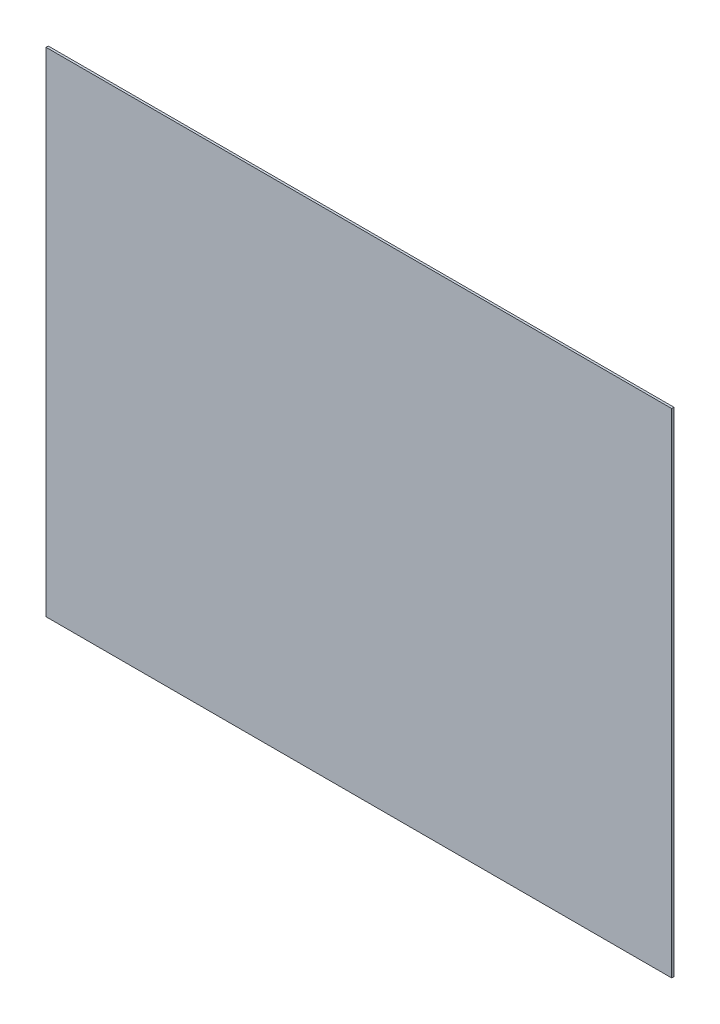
ISO-10303-21;
HEADER;
FILE_DESCRIPTION(('STEP AP214'),'2;1');
FILE_NAME('part.step','',(''),(''),'','','');
FILE_SCHEMA(('AUTOMOTIVE_DESIGN { 1 0 10303 214 1 1 1 1 }'));
ENDSEC;
DATA;
#1=APPLICATION_CONTEXT('core data for automotive mechanical design processes');
#2=APPLICATION_PROTOCOL_DEFINITION('international standard','automotive_design',2000,#1);
#3=PRODUCT_CONTEXT('',#1,'mechanical');
#4=PRODUCT('Part','Part','',(#3));
#5=PRODUCT_RELATED_PRODUCT_CATEGORY('part','',(#4));
#6=PRODUCT_DEFINITION_FORMATION('','',#4);
#7=PRODUCT_DEFINITION_CONTEXT('part definition',#1,'design');
#8=PRODUCT_DEFINITION('design','',#6,#7);
#9=PRODUCT_DEFINITION_SHAPE('','',#8);
#10=(LENGTH_UNIT() NAMED_UNIT(*) SI_UNIT(.MILLI.,.METRE.));
#11=(NAMED_UNIT(*) PLANE_ANGLE_UNIT() SI_UNIT($,.RADIAN.));
#12=(NAMED_UNIT(*) SI_UNIT($,.STERADIAN.) SOLID_ANGLE_UNIT());
#13=UNCERTAINTY_MEASURE_WITH_UNIT(LENGTH_MEASURE(1.E-05),#10,'distance_accuracy_value','');
#14=(GEOMETRIC_REPRESENTATION_CONTEXT(3) GLOBAL_UNCERTAINTY_ASSIGNED_CONTEXT((#13)) GLOBAL_UNIT_ASSIGNED_CONTEXT((#10,
#11,#12)) REPRESENTATION_CONTEXT('',''));
#15=CARTESIAN_POINT('',(0.,0.,0.));
#16=DIRECTION('',(0.,0.,1.));
#17=DIRECTION('',(1.,0.,0.));
#18=AXIS2_PLACEMENT_3D('',#15,#16,#17);
#19=CARTESIAN_POINT('',(-42500.,33500.,304.8));
#20=DIRECTION('',(0.,-1.,0.));
#21=DIRECTION('',(1.,0.,0.));
#22=AXIS2_PLACEMENT_3D('',#19,#20,#21);
#23=PLANE('',#22);
#24=DIRECTION('',(-1.,0.,0.));
#25=VECTOR('',#24,1.);
#26=CARTESIAN_POINT('',(-42500.,33500.,0.));
#27=LINE('',#26,#25);
#28=CARTESIAN_POINT('',(42500.,33500.,0.));
#29=VERTEX_POINT('',#28);
#30=CARTESIAN_POINT('',(-42500.,33500.,0.));
#31=VERTEX_POINT('',#30);
#32=EDGE_CURVE('E114',#29,#31,#27,.T.);
#33=ORIENTED_EDGE('',*,*,#32,.T.);
#34=DIRECTION('',(0.,0.,-1.));
#35=VECTOR('',#34,1.);
#36=CARTESIAN_POINT('',(-42500.,33500.,304.8));
#37=LINE('',#36,#35);
#38=CARTESIAN_POINT('',(-42500.,33500.,304.8));
#39=VERTEX_POINT('',#38);
#40=EDGE_CURVE('E11',#39,#31,#37,.T.);
#41=ORIENTED_EDGE('',*,*,#40,.F.);
#42=DIRECTION('',(-1.,0.,0.));
#43=VECTOR('',#42,1.);
#44=CARTESIAN_POINT('',(-42500.,33500.,304.8));
#45=LINE('',#44,#43);
#46=CARTESIAN_POINT('',(42500.,33500.,304.8));
#47=VERTEX_POINT('',#46);
#48=EDGE_CURVE('E100',#47,#39,#45,.T.);
#49=ORIENTED_EDGE('',*,*,#48,.F.);
#50=DIRECTION('',(0.,0.,-1.));
#51=VECTOR('',#50,1.);
#52=CARTESIAN_POINT('',(42500.,33500.,304.8));
#53=LINE('',#52,#51);
#54=EDGE_CURVE('E110',#47,#29,#53,.T.);
#55=ORIENTED_EDGE('',*,*,#54,.T.);
#56=EDGE_LOOP('',(#33,#41,#49,#55));
#57=FACE_BOUND('',#56,.T.);
#58=ADVANCED_FACE('F44',(#57),#23,.F.);
#59=CARTESIAN_POINT('',(-42500.,-33500.,304.8));
#60=DIRECTION('',(1.,0.,0.));
#61=DIRECTION('',(0.,0.,-1.));
#62=AXIS2_PLACEMENT_3D('',#59,#60,#61);
#63=PLANE('',#62);
#64=DIRECTION('',(0.,-1.,0.));
#65=VECTOR('',#64,1.);
#66=CARTESIAN_POINT('',(-42500.,-33500.,0.));
#67=LINE('',#66,#65);
#68=CARTESIAN_POINT('',(-42500.,-33500.,0.));
#69=VERTEX_POINT('',#68);
#70=EDGE_CURVE('E105',#31,#69,#67,.T.);
#71=ORIENTED_EDGE('',*,*,#70,.T.);
#72=DIRECTION('',(0.,0.,-1.));
#73=VECTOR('',#72,1.);
#74=CARTESIAN_POINT('',(-42500.,-33500.,304.8));
#75=LINE('',#74,#73);
#76=CARTESIAN_POINT('',(-42500.,-33500.,304.8));
#77=VERTEX_POINT('',#76);
#78=EDGE_CURVE('E53',#77,#69,#75,.T.);
#79=ORIENTED_EDGE('',*,*,#78,.F.);
#80=DIRECTION('',(0.,-1.,0.));
#81=VECTOR('',#80,1.);
#82=CARTESIAN_POINT('',(-42500.,-33500.,304.8));
#83=LINE('',#82,#81);
#84=EDGE_CURVE('E95',#39,#77,#83,.T.);
#85=ORIENTED_EDGE('',*,*,#84,.F.);
#86=ORIENTED_EDGE('',*,*,#40,.T.);
#87=EDGE_LOOP('',(#71,#79,#85,#86));
#88=FACE_BOUND('',#87,.T.);
#89=ADVANCED_FACE('F102',(#88),#63,.F.);
#90=CARTESIAN_POINT('',(-42500.,-33500.,304.8));
#91=DIRECTION('',(0.,1.,0.));
#92=DIRECTION('',(0.,0.,1.));
#93=AXIS2_PLACEMENT_3D('',#90,#91,#92);
#94=PLANE('',#93);
#95=DIRECTION('',(1.,0.,0.));
#96=VECTOR('',#95,1.);
#97=CARTESIAN_POINT('',(-42500.,-33500.,0.));
#98=LINE('',#97,#96);
#99=CARTESIAN_POINT('',(42500.,-33500.,0.));
#100=VERTEX_POINT('',#99);
#101=EDGE_CURVE('E80',#69,#100,#98,.T.);
#102=ORIENTED_EDGE('',*,*,#101,.T.);
#103=DIRECTION('',(0.,0.,-1.));
#104=VECTOR('',#103,1.);
#105=CARTESIAN_POINT('',(42500.,-33500.,304.8));
#106=LINE('',#105,#104);
#107=CARTESIAN_POINT('',(42500.,-33500.,304.8));
#108=VERTEX_POINT('',#107);
#109=EDGE_CURVE('E101',#108,#100,#106,.T.);
#110=ORIENTED_EDGE('',*,*,#109,.F.);
#111=DIRECTION('',(1.,0.,0.));
#112=VECTOR('',#111,1.);
#113=CARTESIAN_POINT('',(-42500.,-33500.,304.8));
#114=LINE('',#113,#112);
#115=EDGE_CURVE('E94',#77,#108,#114,.T.);
#116=ORIENTED_EDGE('',*,*,#115,.F.);
#117=ORIENTED_EDGE('',*,*,#78,.T.);
#118=EDGE_LOOP('',(#102,#110,#116,#117));
#119=FACE_BOUND('',#118,.T.);
#120=ADVANCED_FACE('F103',(#119),#94,.F.);
#121=CARTESIAN_POINT('',(42500.,-33500.,304.8));
#122=DIRECTION('',(-1.,0.,0.));
#123=DIRECTION('',(0.,0.,1.));
#124=AXIS2_PLACEMENT_3D('',#121,#122,#123);
#125=PLANE('',#124);
#126=DIRECTION('',(0.,1.,0.));
#127=VECTOR('',#126,1.);
#128=CARTESIAN_POINT('',(42500.,-33500.,0.));
#129=LINE('',#128,#127);
#130=EDGE_CURVE('E82',#100,#29,#129,.T.);
#131=ORIENTED_EDGE('',*,*,#130,.T.);
#132=ORIENTED_EDGE('',*,*,#54,.F.);
#133=DIRECTION('',(0.,1.,0.));
#134=VECTOR('',#133,1.);
#135=CARTESIAN_POINT('',(42500.,-33500.,304.8));
#136=LINE('',#135,#134);
#137=EDGE_CURVE('E62',#108,#47,#136,.T.);
#138=ORIENTED_EDGE('',*,*,#137,.F.);
#139=ORIENTED_EDGE('',*,*,#109,.T.);
#140=EDGE_LOOP('',(#131,#132,#138,#139));
#141=FACE_BOUND('',#140,.T.);
#142=ADVANCED_FACE('F126',(#141),#125,.F.);
#143=CARTESIAN_POINT('',(0.,0.,304.8));
#144=DIRECTION('',(0.,0.,1.));
#145=DIRECTION('',(1.,0.,0.));
#146=AXIS2_PLACEMENT_3D('',#143,#144,#145);
#147=PLANE('',#146);
#148=ORIENTED_EDGE('',*,*,#48,.T.);
#149=ORIENTED_EDGE('',*,*,#84,.T.);
#150=ORIENTED_EDGE('',*,*,#115,.T.);
#151=ORIENTED_EDGE('',*,*,#137,.T.);
#152=EDGE_LOOP('',(#148,#149,#150,#151));
#153=FACE_BOUND('',#152,.T.);
#154=ADVANCED_FACE('F93',(#153),#147,.T.);
#155=CARTESIAN_POINT('',(0.,0.,0.));
#156=DIRECTION('',(0.,0.,1.));
#157=DIRECTION('',(1.,0.,0.));
#158=AXIS2_PLACEMENT_3D('',#155,#156,#157);
#159=PLANE('',#158);
#160=ORIENTED_EDGE('',*,*,#32,.F.);
#161=ORIENTED_EDGE('',*,*,#130,.F.);
#162=ORIENTED_EDGE('',*,*,#101,.F.);
#163=ORIENTED_EDGE('',*,*,#70,.F.);
#164=EDGE_LOOP('',(#160,#161,#162,#163));
#165=FACE_BOUND('',#164,.T.);
#166=ADVANCED_FACE('F131',(#165),#159,.F.);
#167=CLOSED_SHELL('',(#58,#89,#120,#142,#154,#166));
#168=MANIFOLD_SOLID_BREP('B2',#167);
#169=ADVANCED_BREP_SHAPE_REPRESENTATION('',(#18,#168),#14);
#170=SHAPE_DEFINITION_REPRESENTATION(#9,#169);
ENDSEC;
END-ISO-10303-21;
